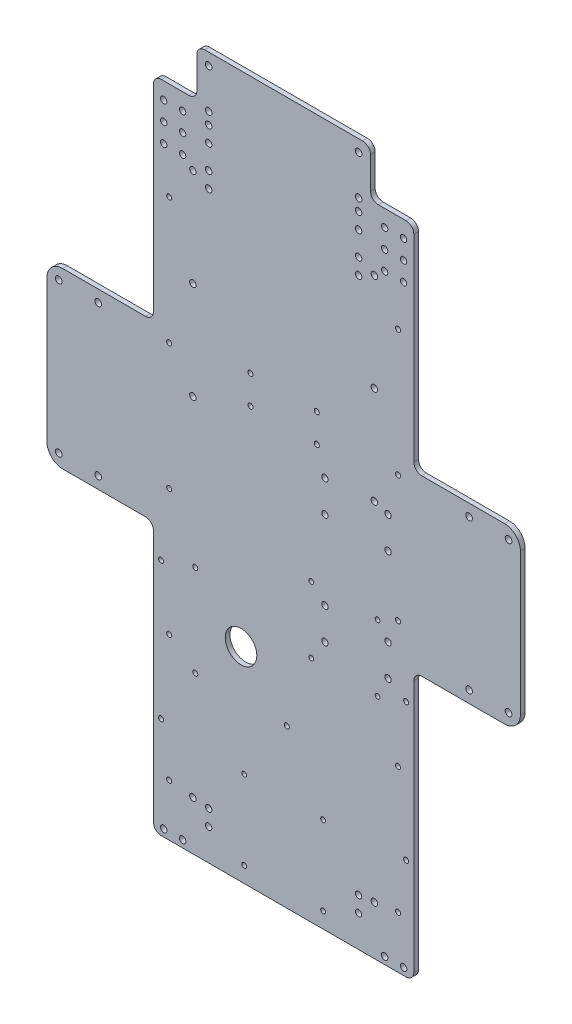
from build123d import *

# Parameters (mm, degrees)
EXTRUDE_1_DEPTH      = 3
SKETCH_2_W           = 110
SKETCH_2_H           = 20
EXTRUDE_2_DEPTH      = 3
SKETCH_3_W           = 60
SKETCH_3_H           = 150
EXTRUDE_3_DEPTH      = 3
SKETCH_4_W           = 100
SKETCH_4_H           = 170
EXTRUDE_4_DEPTH      = 3
SKETCH_5_R           = 2.05
CUT_EXTRUDE_1_DEPTH  = 10
SKETCH_6_R           = 1.5
CUT_EXTRUDE_2_DEPTH  = 10
SKETCH_7_W           = 60
SKETCH_7_H           = 55
EXTRUDE_5_DEPTH      = 3
SKETCH_8_R           = 2
CUT_EXTRUDE_3_DEPTH  = 10
SKETCH_9_R           = 2
CUT_EXTRUDE_4_DEPTH  = 10
SKETCH_10_W          = 5
SKETCH_10_H          = 90
EXTRUDE_6_DEPTH      = 3
SKETCH_11_W          = 110
SKETCH_11_H          = 5
EXTRUDE_7_DEPTH      = 3
SKETCH_12_R          = 2
CUT_EXTRUDE_6_DEPTH  = 10
SKETCH_14_W          = 24
SKETCH_14_H          = 15
SKETCH_14_H_2        = 80
CUT_EXTRUDE_7_DEPTH  = 8
SKETCH_15_R          = 2
CUT_EXTRUDE_8_DEPTH  = 8
SKETCH_16_W          = 110
SKETCH_16_H          = 30
EXTRUDE_8_DEPTH      = 3
SKETCH_18_W          = 110
SKETCH_18_H          = 5
CUT_EXTRUDE_11_DEPTH = 10
SKETCH_19_W          = 3.5
SKETCH_19_H          = 15
SKETCH_19_H_2        = 80
CUT_EXTRUDE_12_DEPTH = 10
SKETCH_20_W          = 27.5
SKETCH_20_H          = 120
SKETCH_20_H_2        = 90
EXTRUDE_9_DEPTH      = 3
SKETCH_21_R          = 2
CUT_EXTRUDE_13_DEPTH = 10
SKETCH_22_R          = 2.05
CUT_EXTRUDE_14_DEPTH = 10
SKETCH_26_R          = 2.06
CUT_EXTRUDE_22_DEPTH = 3
SKETCH_27_R          = 2.05
CUT_EXTRUDE_23_DEPTH = 125
SKETCH_29_R          = 2
CUT_EXTRUDE_25_DEPTH = 10
FILLET_1_R           = 5
SKETCH_30_R          = 1.6
CUT_EXTRUDE_27_DEPTH = 55
SKETCH_31_R          = 2
EXTRUDE_10_DEPTH     = 3
EXTRUDE_START        = -3
EXTRUDE_11_DEPTH     = 3
FILLET_2_R           = 10
SKETCH_33_R          = 2.1
CUT_EXTRUDE_28_DEPTH = 10
SKETCH_34_W          = 110
SKETCH_34_H          = 30
EXTRUDE_12_DEPTH     = 3
FILLET_3_R           = 5
SKETCH_35_R          = 2.1
CUT_EXTRUDE_29_DEPTH = 10
SKETCH_37_R          = 1.6
SKETCH_37_R_2        = 10
CUT_EXTRUDE_30_DEPTH = 10
SKETCH_38_R          = 1.5
CUT_EXTRUDE_31_DEPTH = 10
SKETCH_39_R          = 1.6
CUT_EXTRUDE_32_DEPTH = 40
SKETCH_40_R          = 1.6
CUT_EXTRUDE_33_DEPTH = 10


with BuildPart() as part:
    # Sketch 1 → Extrude 1 (new body)
    with BuildSketch(Plane.XY):
        Polygon((-50.906148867, 33.495145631), (-35.906148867, 33.495145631), (-35.906148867, -91.504854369), (64.093851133, -91.504854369), (64.093851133, 33.495145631), (79.093851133, 33.495145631), (79.093851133, 103.495145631), (-50.906148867, 103.495145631), align=None)
    extrude(amount=EXTRUDE_1_DEPTH)

    # Sketch 2 → Extrude 2 (add)
    with BuildSketch(Plane.XY.offset(3)):
        with Locations((14.093851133, 113.495145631)):
            Rectangle(SKETCH_2_W, SKETCH_2_H)
    extrude(amount=-EXTRUDE_2_DEPTH)

    # Sketch 3 → Extrude 3 (add)
    with BuildSketch(Plane.XY.offset(3)):
        with Locations((-65.906148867, -41.504854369)):
            Rectangle(SKETCH_3_W, SKETCH_3_H)
        with Locations((94.093851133, -41.504854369)):
            Rectangle(SKETCH_3_W, SKETCH_3_H)
    extrude(amount=-EXTRUDE_3_DEPTH)

    # Sketch 4 → Extrude 4 (add)
    with BuildSketch(Plane.XY.offset(3)):
        with Locations((14.093851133, -176.504854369)):
            Rectangle(SKETCH_4_W, SKETCH_4_H)
    extrude(amount=-EXTRUDE_4_DEPTH)

    # Sketch 5 → Cut-Extrude 1 (cut)
    with BuildSketch(Plane(origin=(0, 0, 0), x_dir=(-1, 0, 0), z_dir=(0, 0, -1))):
        with Locations((-61.593851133, 118.495145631)):
            Circle(SKETCH_5_R)
        with Locations((-61.593851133, 108.495145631)):
            Circle(SKETCH_5_R)
        with Locations(Location((33.406148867, 108.495145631, 0), (0, 0, 180))):
            Circle(SKETCH_5_R)
        with Locations(Location((33.406148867, 118.495145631, 0), (0, 0, 180))):
            Circle(SKETCH_5_R)
    extrude(amount=-CUT_EXTRUDE_1_DEPTH, mode=Mode.SUBTRACT)

    # Sketch 6 → Cut-Extrude 2 (cut)
    with BuildSketch(Plane(origin=(0, 0, 0), x_dir=(-1, 0, 0), z_dir=(0, 0, -1))):
        with Locations((10.906148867, -201.504854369)):
            Circle(SKETCH_6_R)
        with Locations((-39.093851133, -201.504854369)):
            Circle(SKETCH_6_R)
        with Locations((-39.093851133, -251.504854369)):
            Circle(SKETCH_6_R)
        with Locations((10.906148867, -251.504854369)):
            Circle(SKETCH_6_R)
    extrude(amount=-CUT_EXTRUDE_2_DEPTH, mode=Mode.SUBTRACT)

    # Sketch 7 → Extrude 5 (add)
    with BuildSketch(Plane(origin=(0, 0, 0), x_dir=(-1, 0, 0), z_dir=(0, 0, -1))):
        with Locations((-94.093851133, -144.004854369)):
            Rectangle(SKETCH_7_W, SKETCH_7_H)
        with Locations((65.906148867, -144.004854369)):
            Rectangle(SKETCH_7_W, SKETCH_7_H)
    extrude(amount=-EXTRUDE_5_DEPTH)

    # Sketch 8 → Cut-Extrude 3 (cut)
    with BuildSketch(Plane(origin=(0, 0, 0), x_dir=(-1, 0, 0), z_dir=(0, 0, -1))):
        with Locations((-114.093851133, 10.995145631)):
            Circle(SKETCH_8_R)
        with Locations((-104.093851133, 10.995145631)):
            Circle(SKETCH_8_R)
        with Locations(Location((-104.093851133, -84.004854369, 0), (0, 0, 180))):
            Circle(SKETCH_8_R)
        with Locations(Location((-114.093851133, -84.004854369, 0), (0, 0, 180))):
            Circle(SKETCH_8_R)
        with Locations((85.906148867, -84.004854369)):
            Circle(SKETCH_8_R)
        with Locations((75.906148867, -84.004854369)):
            Circle(SKETCH_8_R)
        with Locations(Location((75.906148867, 10.995145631, 0), (0, 0, 180))):
            Circle(SKETCH_8_R)
        with Locations(Location((85.906148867, 10.995145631, 0), (0, 0, 180))):
            Circle(SKETCH_8_R)
    extrude(amount=-CUT_EXTRUDE_3_DEPTH, mode=Mode.SUBTRACT)

    # Sketch 9 → Cut-Extrude 4 (cut)
    with BuildSketch(Plane(origin=(0, 0, 0), x_dir=(-1, 0, 0), z_dir=(0, 0, -1))):
        with Locations((33.406148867, -231.504854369)):
            Circle(SKETCH_9_R)
        with Locations((33.406148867, -241.504854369)):
            Circle(SKETCH_9_R)
        with Locations(Location((-61.593851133, -241.504854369, 0), (0, 0, 180))):
            Circle(SKETCH_9_R)
        with Locations(Location((-61.593851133, -231.504854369, 0), (0, 0, 180))):
            Circle(SKETCH_9_R)
    extrude(amount=-CUT_EXTRUDE_4_DEPTH, mode=Mode.SUBTRACT)

    # Sketch 10 → Extrude 6 (add)
    with BuildSketch(Plane(origin=(0, 0, 0), x_dir=(-1, 0, 0), z_dir=(0, 0, -1))):
        with Locations((-66.593851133, -216.504854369)):
            Rectangle(SKETCH_10_W, SKETCH_10_H)
        with Locations((38.406148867, -216.504854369)):
            Rectangle(SKETCH_10_W, SKETCH_10_H)
    extrude(amount=-EXTRUDE_6_DEPTH)

    # Sketch 11 → Extrude 7 (add)
    with BuildSketch(Plane(origin=(0, 0, 0), x_dir=(-1, 0, 0), z_dir=(0, 0, -1))):
        with Locations((-14.093851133, -264.004854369)):
            Rectangle(SKETCH_11_W, SKETCH_11_H)
    extrude(amount=-EXTRUDE_7_DEPTH)

    # Sketch 12 → Cut-Extrude 6 (cut)
    with BuildSketch(Plane(origin=(0, 0, 0), x_dir=(-1, 0, 0), z_dir=(0, 0, -1))):
        with Locations((-40.266570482, -13.363358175)):
            Circle(SKETCH_12_R)
        with Locations((-40.266570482, -103.363358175)):
            Circle(SKETCH_12_R)
        with Locations((-80.266570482, -103.363358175)):
            Circle(SKETCH_12_R)
        with Locations((-80.266570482, -13.363358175)):
            Circle(SKETCH_12_R)
    extrude(amount=-CUT_EXTRUDE_6_DEPTH, mode=Mode.SUBTRACT)

    # Sketch 14 → Cut-Extrude 7 (cut)
    with BuildSketch(Plane(origin=(0, 0, 0), x_dir=(-1, 0, 0), z_dir=(0, 0, -1))):
        with Locations((-112.093851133, 25.995145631)):
            Rectangle(SKETCH_14_W, SKETCH_14_H)
        with Locations((-112.093851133, -131.504854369)):
            Rectangle(SKETCH_14_W, SKETCH_14_H_2)
        with Locations((83.906148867, -131.504854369)):
            Rectangle(SKETCH_14_W, SKETCH_14_H_2)
        with Locations((83.906148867, 25.995145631)):
            Rectangle(SKETCH_14_W, SKETCH_14_H)
    extrude(amount=-CUT_EXTRUDE_7_DEPTH, mode=Mode.SUBTRACT)

    # Sketch 15 → Cut-Extrude 8 (cut)
    with BuildSketch(Plane(origin=(0, 0, 0), x_dir=(-1, 0, 0), z_dir=(0, 0, -1))):
        with Locations((-80.266570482, -33.363358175)):
            Circle(SKETCH_15_R)
        with Locations((-40.266570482, -33.363358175)):
            Circle(SKETCH_15_R)
        with Locations((-80.266570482, -83.363358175)):
            Circle(SKETCH_15_R)
        with Locations((-40.266570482, -83.363358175)):
            Circle(SKETCH_15_R)
    extrude(amount=-CUT_EXTRUDE_8_DEPTH, mode=Mode.SUBTRACT)

    # Sketch 16 → Extrude 8 (add)
    with BuildSketch(Plane(origin=(0, 0, 0), x_dir=(-1, 0, 0), z_dir=(0, 0, -1))):
        with Locations((-14.093851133, 138.495145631)):
            Rectangle(SKETCH_16_W, SKETCH_16_H)
    extrude(amount=-EXTRUDE_8_DEPTH)

    # Sketch 18 → Cut-Extrude 11 (cut)
    with BuildSketch(Plane(origin=(0, 0, 0), x_dir=(-1, 0, 0), z_dir=(0, 0, -1))):
        with Locations((-14.093851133, -264.004854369)):
            Rectangle(SKETCH_18_W, SKETCH_18_H)
    extrude(amount=-CUT_EXTRUDE_11_DEPTH, mode=Mode.SUBTRACT)

    # Sketch 19 → Cut-Extrude 12 (cut)
    with BuildSketch(Plane(origin=(0, 0, 0), x_dir=(-1, 0, 0), z_dir=(0, 0, -1))):
        with Locations((-98.343851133, 25.995145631)):
            Rectangle(SKETCH_19_W, SKETCH_19_H)
        with Locations((70.156148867, 25.995145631)):
            Rectangle(SKETCH_19_W, SKETCH_19_H)
        with Locations((70.156148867, -131.504854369)):
            Rectangle(SKETCH_19_W, SKETCH_19_H_2)
        with Locations((-98.343851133, -131.504854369)):
            Rectangle(SKETCH_19_W, SKETCH_19_H_2)
    extrude(amount=-CUT_EXTRUDE_12_DEPTH, mode=Mode.SUBTRACT)

    # Sketch 20 → Extrude 9 (add)
    with BuildSketch(Plane(origin=(0, 0, 0), x_dir=(-1, 0, 0), z_dir=(0, 0, -1))):
        with Locations((-82.843851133, 93.495145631)):
            Rectangle(SKETCH_20_W, SKETCH_20_H)
        with Locations((54.656148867, 93.495145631)):
            Rectangle(SKETCH_20_W, SKETCH_20_H)
        with Locations((-82.843851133, -216.504854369)):
            Rectangle(SKETCH_20_W, SKETCH_20_H_2)
        with Locations((54.656148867, -216.504854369)):
            Rectangle(SKETCH_20_W, SKETCH_20_H_2)
    extrude(amount=-EXTRUDE_9_DEPTH)

    # Sketch 21 → Cut-Extrude 13 (cut)
    with BuildSketch(Plane(origin=(0, 0, 0), x_dir=(-1, 0, 0), z_dir=(0, 0, -1))):
        with Locations((61.906148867, 130.995145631)):
            Circle(SKETCH_21_R)
        with Locations((49.906148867, 130.995145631)):
            Circle(SKETCH_21_R)
        with Locations(Location((-78.093851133, 130.995145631, 0), (0, 0, 180))):
            Circle(SKETCH_21_R)
        with Locations(Location((-90.093851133, 130.995145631, 0), (0, 0, 180))):
            Circle(SKETCH_21_R)
        with Locations((61.906148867, 142.995145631)):
            Circle(SKETCH_21_R)
        with Locations((49.906148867, 142.995145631)):
            Circle(SKETCH_21_R)
        with Locations(Location((-78.093851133, 142.995145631, 0), (0, 0, 180))):
            Circle(SKETCH_21_R)
        with Locations(Location((-90.093851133, 142.995145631, 0), (0, 0, 180))):
            Circle(SKETCH_21_R)
    extrude(amount=-CUT_EXTRUDE_13_DEPTH, mode=Mode.SUBTRACT)

    # Sketch 22 → Cut-Extrude 14 (cut)
    with BuildSketch(Plane(origin=(0, 0, 0), x_dir=(-1, 0, 0), z_dir=(0, 0, -1))):
        with Locations((-90.093851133, -257.004854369)):
            Circle(SKETCH_22_R)
        with Locations((-78.093851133, -257.004854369)):
            Circle(SKETCH_22_R)
        with Locations(Location((49.906148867, -257.004854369, 0), (0, 0, 180))):
            Circle(SKETCH_22_R)
        with Locations(Location((61.906148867, -257.004854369, 0), (0, 0, 180))):
            Circle(SKETCH_22_R)
    extrude(amount=-CUT_EXTRUDE_14_DEPTH, mode=Mode.SUBTRACT)

    # Sketch 26 → Cut-Extrude 22 (cut)
    with BuildSketch(Plane(origin=(0, 0, 0), x_dir=(-1, 0, 0), z_dir=(0, 0, -1))):
        with Locations((43.406148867, 113.495145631)):
            Circle(SKETCH_26_R)
        with Locations(Location((-71.593851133, 113.495145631, 0), (0, 0, 180))):
            Circle(SKETCH_26_R)
        with Locations((43.406148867, 51.495145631)):
            Circle(SKETCH_26_R)
        with Locations(Location((-71.593851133, 51.495145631, 0), (0, 0, 180))):
            Circle(SKETCH_26_R)
        with Locations((43.406148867, -10.504854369)):
            Circle(SKETCH_26_R)
        with Locations(Location((-71.593851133, -10.504854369, 0), (0, 0, 180))):
            Circle(SKETCH_26_R)
        with Locations((43.406148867, -230.504854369)):
            Circle(SKETCH_26_R)
        with Locations(Location((-71.593851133, -230.504854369, 0), (0, 0, 180))):
            Circle(SKETCH_26_R)
    extrude(amount=-CUT_EXTRUDE_22_DEPTH, mode=Mode.SUBTRACT)

    # Sketch 27 → Cut-Extrude 23 (cut)
    with BuildSketch(Plane(origin=(0, 0, 0), x_dir=(-1, 0, 0), z_dir=(0, 0, -1))):
        with Locations(Location((33.406148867, 108.495145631, 0), (0, 0, 180))):
            Circle(SKETCH_27_R)
        with Locations(Location((33.406148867, 118.495145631, 0), (0, 0, 180))):
            Circle(SKETCH_27_R)
        with Locations((-61.593851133, 108.495145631)):
            Circle(SKETCH_27_R)
        with Locations((-61.593851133, 118.495145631)):
            Circle(SKETCH_27_R)
        with Locations((33.406148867, 133.495145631)):
            Circle(SKETCH_27_R)
        with Locations((33.406148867, 143.495145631)):
            Circle(SKETCH_27_R)
        with Locations((-61.593851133, 133.495145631)):
            Circle(SKETCH_27_R)
        with Locations((-61.593851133, 143.495145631)):
            Circle(SKETCH_27_R)
    extrude(amount=-CUT_EXTRUDE_23_DEPTH, mode=Mode.SUBTRACT)

    # Sketch 29 → Cut-Extrude 25 (cut)
    with BuildSketch(Plane(origin=(0, 0, 0), x_dir=(-1, 0, 0), z_dir=(0, 0, -1))):
        with Locations((61.906148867, 130.995145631)):
            Circle(SKETCH_29_R)
        with Locations((49.906148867, 130.995145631)):
            Circle(SKETCH_29_R)
        with Locations(Location((-78.093851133, 130.995145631, 0), (0, 0, 180))):
            Circle(SKETCH_29_R)
        with Locations(Location((-90.093851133, 130.995145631, 0), (0, 0, 180))):
            Circle(SKETCH_29_R)
        with Locations((61.906148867, 118.995145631)):
            Circle(SKETCH_29_R)
        with Locations((49.906148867, 118.995145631)):
            Circle(SKETCH_29_R)
        with Locations((-78.093851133, 118.995145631)):
            Circle(SKETCH_29_R)
        with Locations((-90.093851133, 118.995145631)):
            Circle(SKETCH_29_R)
    extrude(amount=-CUT_EXTRUDE_25_DEPTH, mode=Mode.SUBTRACT)

    # Fillet 1
    fillet_1_edges = [part.edges().sort_by_distance(p)[0] for p in [
        (124.093851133, 18.495145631, 1.5),
        (-95.906148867, 18.495145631, 1.5),
        (124.093851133, -91.504854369, 1.5),
        (-95.906148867, -91.504854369, 1.5),
        (96.593851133, 18.495145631, 1.5),
        (-68.406148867, 18.495145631, 1.5),
        (-68.406148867, -91.504854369, 1.5),
        (96.593851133, -91.504854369, 1.5),
        (96.593851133, 153.495145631, 1.5),
        (-68.406148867, 153.495145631, 1.5),
        (96.593851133, -261.504854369, 1.5),
        (-68.406148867, -261.504854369, 1.5),
    ]]
    fillet(fillet_1_edges, radius=FILLET_1_R)

    # Sketch 30 → Cut-Extrude 27 (cut)
    with BuildSketch(Plane(origin=(0, 0, 0), x_dir=(-1, 0, 0), z_dir=(0, 0, -1))):
        with Locations((58.406148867, -228.504854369)):
            Circle(SKETCH_30_R)
        with Locations((58.406148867, -148.504854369)):
            Circle(SKETCH_30_R)
        with Locations((58.406148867, -68.504854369)):
            Circle(SKETCH_30_R)
        with Locations((58.406148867, 11.495145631)):
            Circle(SKETCH_30_R)
        with Locations((58.406148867, 91.495145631)):
            Circle(SKETCH_30_R)
        with Locations(Location((-86.593851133, 91.495145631, 0), (0, 0, 180))):
            Circle(SKETCH_30_R)
        with Locations(Location((-86.593851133, 11.495145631, 0), (0, 0, 180))):
            Circle(SKETCH_30_R)
        with Locations(Location((-86.593851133, -68.504854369, 0), (0, 0, 180))):
            Circle(SKETCH_30_R)
        with Locations(Location((-86.593851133, -148.504854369, 0), (0, 0, 180))):
            Circle(SKETCH_30_R)
        with Locations(Location((-86.593851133, -228.504854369, 0), (0, 0, 180))):
            Circle(SKETCH_30_R)
    extrude(amount=-CUT_EXTRUDE_27_DEPTH, mode=Mode.SUBTRACT)

    # Sketch 31 → Extrude 10 (add)
    with BuildSketch(Plane(origin=(0, 0, 0), x_dir=(-1, 0, 0), z_dir=(0, 0, -1))):
        with Locations((-114.093851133, -84.004854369)):
            Circle(SKETCH_31_R)
        with Locations((-104.093851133, -84.004854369)):
            Circle(SKETCH_31_R)
        with Locations((-114.093851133, 10.995145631)):
            Circle(SKETCH_31_R)
        with Locations((-104.093851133, 10.995145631)):
            Circle(SKETCH_31_R)
        with Locations((75.906148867, -84.004854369)):
            Circle(SKETCH_31_R)
        with Locations((85.906148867, -84.004854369)):
            Circle(SKETCH_31_R)
        with Locations((75.906148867, 10.995145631)):
            Circle(SKETCH_31_R)
        with Locations((85.906148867, 10.995145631)):
            Circle(SKETCH_31_R)
    extrude(amount=-EXTRUDE_10_DEPTH)

    # Sketch 32 → Extrude 11 (add)
    with BuildSketch(Plane(origin=(0, 0, 0), x_dir=(-1, 0, 0), z_dir=(0, 0, -1)).offset(EXTRUDE_START)):
        with BuildLine():
            ThreePointArc((95.906148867, 13.495145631), (94.441682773, 17.030679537), (90.906148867, 18.495145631))
            Line((90.906148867, 18.495145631), (135.906148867, 18.495145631))
            Line((135.906148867, 18.495145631), (135.906148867, -91.504854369))
            Line((135.906148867, -91.504854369), (90.906148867, -91.504854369))
            ThreePointArc((90.906148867, -91.504854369), (94.441682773, -90.040388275), (95.906148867, -86.504854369))
            Line((95.906148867, -86.504854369), (95.906148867, 13.495145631))
        make_face()
        with BuildLine():
            ThreePointArc((-124.093851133, -86.504854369), (-122.629385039, -90.040388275), (-119.093851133, -91.504854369))
            Line((-119.093851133, -91.504854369), (-164.093851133, -91.504854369))
            Line((-164.093851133, -91.504854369), (-164.093851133, 18.495145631))
            Line((-164.093851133, 18.495145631), (-119.093851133, 18.495145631))
            ThreePointArc((-119.093851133, 18.495145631), (-122.629385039, 17.030679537), (-124.093851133, 13.495145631))
            Line((-124.093851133, 13.495145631), (-124.093851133, -86.504854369))
        make_face()
    extrude(amount=EXTRUDE_11_DEPTH)

    # Fillet 2
    fillet_2_edges = [part.edges().sort_by_distance(p)[0] for p in [
        (-135.906148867, 18.495145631, 1.5),
        (-135.906148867, -91.504854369, 1.5),
        (164.093851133, -91.504854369, 1.5),
        (164.093851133, 18.495145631, 1.5),
    ]]
    fillet(fillet_2_edges, radius=FILLET_2_R)

    # Sketch 33 → Cut-Extrude 28 (cut)
    with BuildSketch(Plane(origin=(0, 0, 0), x_dir=(-1, 0, 0), z_dir=(0, 0, -1))):
        with Locations((-156.593851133, -84.004854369)):
            Circle(SKETCH_33_R)
        with Locations((-131.593851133, -84.004854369)):
            Circle(SKETCH_33_R)
        with Locations(Location((-131.593851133, 10.995145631, 0), (0, 0, 180))):
            Circle(SKETCH_33_R)
        with Locations(Location((-156.593851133, 10.995145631, 0), (0, 0, 180))):
            Circle(SKETCH_33_R)
        with Locations((128.406148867, 10.995145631)):
            Circle(SKETCH_33_R)
        with Locations((103.406148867, 10.995145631)):
            Circle(SKETCH_33_R)
        with Locations(Location((103.406148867, -84.004854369, 0), (0, 0, 180))):
            Circle(SKETCH_33_R)
        with Locations(Location((128.406148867, -84.004854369, 0), (0, 0, 180))):
            Circle(SKETCH_33_R)
    extrude(amount=-CUT_EXTRUDE_28_DEPTH, mode=Mode.SUBTRACT)

    # Sketch 34 → Extrude 12 (add)
    with BuildSketch(Plane(origin=(0, 0, 0), x_dir=(-1, 0, 0), z_dir=(0, 0, -1))):
        with Locations((-14.093851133, 168.495145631)):
            Rectangle(SKETCH_34_W, SKETCH_34_H)
    extrude(amount=-EXTRUDE_12_DEPTH)

    # Fillet 3
    fillet_3_edges = [part.edges().sort_by_distance(p)[0] for p in [
        (-40.906148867, 153.495145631, 1.5),
        (-40.906148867, 183.495145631, 1.5),
        (69.093851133, 183.495145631, 1.5),
        (69.093851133, 153.495145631, 1.5),
    ]]
    fillet(fillet_3_edges, radius=FILLET_3_R)

    # Sketch 35 → Cut-Extrude 29 (cut)
    with BuildSketch(Plane(origin=(0, 0, 0), x_dir=(-1, 0, 0), z_dir=(0, 0, -1))):
        with Locations((33.406148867, 150.995145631)):
            Circle(SKETCH_35_R)
        with Locations((33.406148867, 175.995145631)):
            Circle(SKETCH_35_R)
        with Locations(Location((-61.593851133, 175.995145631, 0), (0, 0, 180))):
            Circle(SKETCH_35_R)
        with Locations(Location((-61.593851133, 150.995145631, 0), (0, 0, 180))):
            Circle(SKETCH_35_R)
    extrude(amount=-CUT_EXTRUDE_29_DEPTH, mode=Mode.SUBTRACT)

    # Sketch 37 → Cut-Extrude 30 (cut)
    with BuildSketch(Plane.XY.offset(3)):
        with Locations((-41.906148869, -103.504854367)):
            Circle(SKETCH_37_R)
        with Locations((-41.906148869, -161.504854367)):
            Circle(SKETCH_37_R)
        with Locations((16.093851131, -161.504854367)):
            Circle(SKETCH_37_R)
        with Locations((-12.906148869, -132.504854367)):
            Circle(SKETCH_37_R_2)
    extrude(amount=-CUT_EXTRUDE_30_DEPTH, mode=Mode.SUBTRACT)

    # Sketch 38 → Cut-Extrude 31 (cut)
    with BuildSketch(Plane.XY.offset(3)):
        with Locations((31.593851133, -116.504854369)):
            Circle(SKETCH_38_R)
        with Locations((73.593851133, -116.504854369)):
            Circle(SKETCH_38_R)
        with Locations((73.593851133, -74.504854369)):
            Circle(SKETCH_38_R)
        with Locations((31.593851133, -74.504854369)):
            Circle(SKETCH_38_R)
    extrude(amount=-CUT_EXTRUDE_31_DEPTH, mode=Mode.SUBTRACT)

    # Sketch 39 → Cut-Extrude 32 (cut)
    with BuildSketch(Plane(origin=(0, 0, 0), x_dir=(-1, 0, 0), z_dir=(0, 0, -1))):
        with Locations((-91.730895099, -110.40485437)):
            Circle(SKETCH_39_R)
        with Locations((-91.730895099, -197.40485437)):
            Circle(SKETCH_39_R)
        with Locations((63.543192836, -197.40485437)):
            Circle(SKETCH_39_R)
        with Locations((63.543192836, -110.40485437)):
            Circle(SKETCH_39_R)
    extrude(amount=-CUT_EXTRUDE_32_DEPTH, mode=Mode.SUBTRACT)

    # Sketch 40 → Cut-Extrude 33 (cut)
    with BuildSketch(Plane(origin=(0, 0, 0), x_dir=(-1, 0, 0), z_dir=(0, 0, -1))):
        with Locations((-35.093851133, 20.495145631)):
            Circle(SKETCH_40_R)
        with Locations((6.906148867, 20.495145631)):
            Circle(SKETCH_40_R)
        with Locations((6.906148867, 2.495145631)):
            Circle(SKETCH_40_R)
        with Locations((-35.093851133, 2.495145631)):
            Circle(SKETCH_40_R)
    extrude(amount=-CUT_EXTRUDE_33_DEPTH, mode=Mode.SUBTRACT)


solid = part.part
